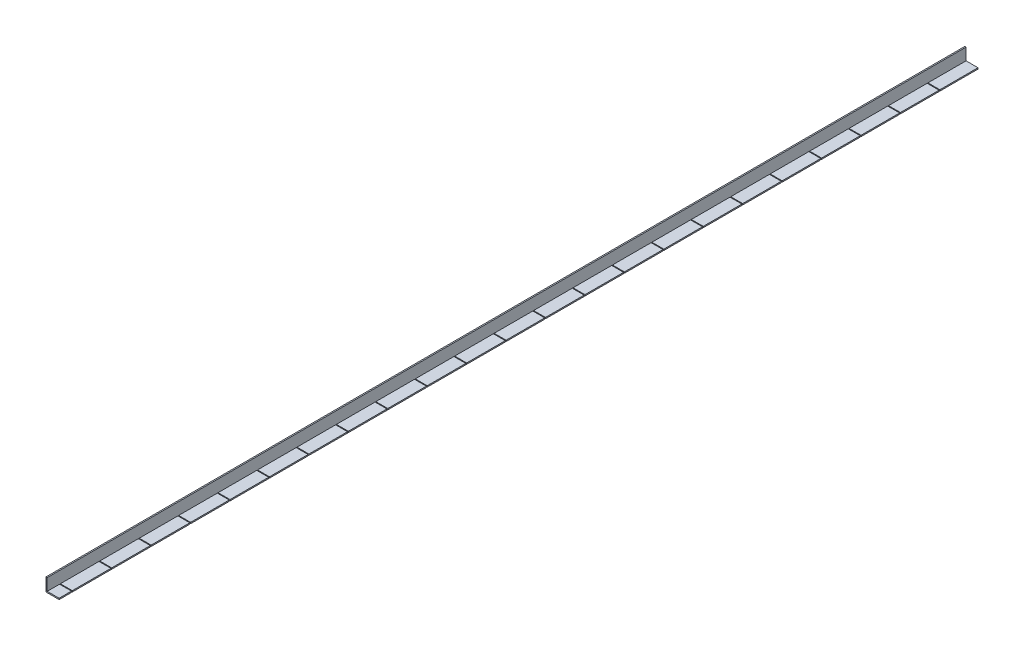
from build123d import *

# Parameters (mm, degrees)
SKETCH1_W            = 50.8
SKETCH1_H            = 3550.92
BOSS_EXTRUDE1_DEPTH  = 4.7625
SKETCH2_W            = 47.625
SKETCH2_H            = 4.7625
BOSS_EXTRUDE2_DEPTH  = 46.0375
SKETCH3_W            = 147.32
SKETCH3_H            = 4.7625
BOSS_EXTRUDE3_DEPTH  = 46.0375
SKETCH4_W            = 149.225
SKETCH4_H            = 4.7625
BOSS_EXTRUDE4_DEPTH  = 46.0375
SKETCH5_W            = 149.225
SKETCH5_H            = 4.7625
BOSS_EXTRUDE5_DEPTH  = 46.0375
SKETCH6_W            = 149.225
SKETCH6_H            = 4.7625
BOSS_EXTRUDE6_DEPTH  = 46.0375
SKETCH7_W            = 149.225
SKETCH7_H            = 4.7625
BOSS_EXTRUDE7_DEPTH  = 46.0375
SKETCH8_W            = 149.225
SKETCH8_H            = 4.7625
BOSS_EXTRUDE8_DEPTH  = 46.0375
SKETCH9_W            = 149.225
SKETCH9_H            = 4.7625
BOSS_EXTRUDE9_DEPTH  = 46.0375
SKETCH10_W           = 149.225
SKETCH10_H           = 4.7625
BOSS_EXTRUDE10_DEPTH = 46.0375
SKETCH11_W           = 149.225
SKETCH11_H           = 4.7625
BOSS_EXTRUDE11_DEPTH = 46.0375
SKETCH12_W           = 149.225
SKETCH12_H           = 4.7625
BOSS_EXTRUDE12_DEPTH = 46.0375
SKETCH13_W           = 149.225
SKETCH13_H           = 4.7625
BOSS_EXTRUDE13_DEPTH = 46.0375
SKETCH14_W           = 149.225
SKETCH14_H           = 4.7625
BOSS_EXTRUDE14_DEPTH = 46.0375
SKETCH15_W           = 149.225
SKETCH15_H           = 4.7625
BOSS_EXTRUDE15_DEPTH = 46.0375
SKETCH16_W           = 149.225
SKETCH16_H           = 4.7625
BOSS_EXTRUDE16_DEPTH = 46.0375
SKETCH17_W           = 149.225
SKETCH17_H           = 4.7625
BOSS_EXTRUDE17_DEPTH = 46.0375
SKETCH18_W           = 149.225
SKETCH18_H           = 4.7625
BOSS_EXTRUDE18_DEPTH = 46.0375
SKETCH19_W           = 149.225
SKETCH19_H           = 4.7625
BOSS_EXTRUDE19_DEPTH = 46.0375
SKETCH20_W           = 149.225
SKETCH20_H           = 4.7625
BOSS_EXTRUDE20_DEPTH = 46.0375
SKETCH21_W           = 149.225
SKETCH21_H           = 4.7625
BOSS_EXTRUDE21_DEPTH = 46.0375
SKETCH22_W           = 149.225
SKETCH22_H           = 4.7625
BOSS_EXTRUDE22_DEPTH = 46.0375
SKETCH23_W           = 149.225
SKETCH23_H           = 4.7625
BOSS_EXTRUDE23_DEPTH = 46.0375
SKETCH24_W           = 149.225
SKETCH24_H           = 4.7625
BOSS_EXTRUDE24_DEPTH = 46.0375
SKETCH25_W           = 149.225
SKETCH25_H           = 4.7625
BOSS_EXTRUDE25_DEPTH = 46.0375


with BuildPart() as part:
    # Sketch1 → Boss-Extrude1 (new body)
    with BuildSketch(Plane(origin=(0, 0, 0), x_dir=(0, -1, 0), z_dir=(-1, 0, 0))):
        with Locations((-25.4, 1775.46)):
            Rectangle(SKETCH1_W, SKETCH1_H)
    extrude(amount=-BOSS_EXTRUDE1_DEPTH)

    # Sketch2 → Boss-Extrude2 (add)
    with BuildSketch(Plane(origin=(4.7625, 0, 0), x_dir=(0, 0, -1), z_dir=(1, 0, 0))):
        with Locations((-3527.1075, 2.38125)):
            Rectangle(SKETCH2_W, SKETCH2_H)
    extrude(amount=BOSS_EXTRUDE2_DEPTH)

    # Sketch3 → Boss-Extrude3 (add)
    with BuildSketch(Plane(origin=(4.7625, 0, 0), x_dir=(0, 0, -1), z_dir=(1, 0, 0))):
        with Locations((-73.66, 2.38125)):
            Rectangle(SKETCH3_W, SKETCH3_H)
    extrude(amount=BOSS_EXTRUDE3_DEPTH)

    # Sketch4 → Boss-Extrude4 (add)
    with BuildSketch(Plane(origin=(4.7625, 0, 0), x_dir=(0, 0, -1), z_dir=(1, 0, 0))):
        with Locations((-3425.5075, 2.38125)):
            Rectangle(SKETCH4_W, SKETCH4_H)
    extrude(amount=BOSS_EXTRUDE4_DEPTH)

    # Sketch5 → Boss-Extrude5 (add)
    with BuildSketch(Plane(origin=(4.7625, 0, 0), x_dir=(0, 0, -1), z_dir=(1, 0, 0))):
        with Locations((-3273.1075, 2.38125)):
            Rectangle(SKETCH5_W, SKETCH5_H)
    extrude(amount=BOSS_EXTRUDE5_DEPTH)

    # Sketch6 → Boss-Extrude6 (add)
    with BuildSketch(Plane(origin=(4.7625, 0, 0), x_dir=(0, 0, -1), z_dir=(1, 0, 0))):
        with Locations((-3120.7075, 2.38125)):
            Rectangle(SKETCH6_W, SKETCH6_H)
    extrude(amount=BOSS_EXTRUDE6_DEPTH)

    # Sketch7 → Boss-Extrude7 (add)
    with BuildSketch(Plane(origin=(4.7625, 0, 0), x_dir=(0, 0, -1), z_dir=(1, 0, 0))):
        with Locations((-2968.3075, 2.38125)):
            Rectangle(SKETCH7_W, SKETCH7_H)
    extrude(amount=BOSS_EXTRUDE7_DEPTH)

    # Sketch8 → Boss-Extrude8 (add)
    with BuildSketch(Plane(origin=(4.7625, 0, 0), x_dir=(0, 0, -1), z_dir=(1, 0, 0))):
        with Locations((-2815.9075, 2.38125)):
            Rectangle(SKETCH8_W, SKETCH8_H)
    extrude(amount=BOSS_EXTRUDE8_DEPTH)

    # Sketch9 → Boss-Extrude9 (add)
    with BuildSketch(Plane(origin=(4.7625, 0, 0), x_dir=(0, 0, -1), z_dir=(1, 0, 0))):
        with Locations((-2663.5075, 2.38125)):
            Rectangle(SKETCH9_W, SKETCH9_H)
    extrude(amount=BOSS_EXTRUDE9_DEPTH)

    # Sketch10 → Boss-Extrude10 (add)
    with BuildSketch(Plane(origin=(4.7625, 0, 0), x_dir=(0, 0, -1), z_dir=(1, 0, 0))):
        with Locations((-2511.1075, 2.38125)):
            Rectangle(SKETCH10_W, SKETCH10_H)
    extrude(amount=BOSS_EXTRUDE10_DEPTH)

    # Sketch11 → Boss-Extrude11 (add)
    with BuildSketch(Plane(origin=(4.7625, 0, 0), x_dir=(0, 0, -1), z_dir=(1, 0, 0))):
        with Locations((-2358.7075, 2.38125)):
            Rectangle(SKETCH11_W, SKETCH11_H)
    extrude(amount=BOSS_EXTRUDE11_DEPTH)

    # Sketch12 → Boss-Extrude12 (add)
    with BuildSketch(Plane(origin=(4.7625, 0, 0), x_dir=(0, 0, -1), z_dir=(1, 0, 0))):
        with Locations((-2206.3075, 2.38125)):
            Rectangle(SKETCH12_W, SKETCH12_H)
    extrude(amount=BOSS_EXTRUDE12_DEPTH)

    # Sketch13 → Boss-Extrude13 (add)
    with BuildSketch(Plane(origin=(4.7625, 0, 0), x_dir=(0, 0, -1), z_dir=(1, 0, 0))):
        with Locations((-2053.9075, 2.38125)):
            Rectangle(SKETCH13_W, SKETCH13_H)
    extrude(amount=BOSS_EXTRUDE13_DEPTH)

    # Sketch14 → Boss-Extrude14 (add)
    with BuildSketch(Plane(origin=(4.7625, 0, 0), x_dir=(0, 0, -1), z_dir=(1, 0, 0))):
        with Locations((-1901.5075, 2.38125)):
            Rectangle(SKETCH14_W, SKETCH14_H)
    extrude(amount=BOSS_EXTRUDE14_DEPTH)

    # Sketch15 → Boss-Extrude15 (add)
    with BuildSketch(Plane(origin=(4.7625, 0, 0), x_dir=(0, 0, -1), z_dir=(1, 0, 0))):
        with Locations((-1749.1075, 2.38125)):
            Rectangle(SKETCH15_W, SKETCH15_H)
    extrude(amount=BOSS_EXTRUDE15_DEPTH)

    # Sketch16 → Boss-Extrude16 (add)
    with BuildSketch(Plane(origin=(4.7625, 0, 0), x_dir=(0, 0, -1), z_dir=(1, 0, 0))):
        with Locations((-1596.7075, 2.38125)):
            Rectangle(SKETCH16_W, SKETCH16_H)
    extrude(amount=BOSS_EXTRUDE16_DEPTH)

    # Sketch17 → Boss-Extrude17 (add)
    with BuildSketch(Plane(origin=(4.7625, 0, 0), x_dir=(0, 0, -1), z_dir=(1, 0, 0))):
        with Locations((-1444.3075, 2.38125)):
            Rectangle(SKETCH17_W, SKETCH17_H)
    extrude(amount=BOSS_EXTRUDE17_DEPTH)

    # Sketch18 → Boss-Extrude18 (add)
    with BuildSketch(Plane(origin=(4.7625, 0, 0), x_dir=(0, 0, -1), z_dir=(1, 0, 0))):
        with Locations((-1291.9075, 2.38125)):
            Rectangle(SKETCH18_W, SKETCH18_H)
    extrude(amount=BOSS_EXTRUDE18_DEPTH)

    # Sketch19 → Boss-Extrude19 (add)
    with BuildSketch(Plane(origin=(4.7625, 0, 0), x_dir=(0, 0, -1), z_dir=(1, 0, 0))):
        with Locations((-1139.5075, 2.38125)):
            Rectangle(SKETCH19_W, SKETCH19_H)
    extrude(amount=BOSS_EXTRUDE19_DEPTH)

    # Sketch20 → Boss-Extrude20 (add)
    with BuildSketch(Plane(origin=(4.7625, 0, 0), x_dir=(0, 0, -1), z_dir=(1, 0, 0))):
        with Locations((-987.1075, 2.38125)):
            Rectangle(SKETCH20_W, SKETCH20_H)
    extrude(amount=BOSS_EXTRUDE20_DEPTH)

    # Sketch21 → Boss-Extrude21 (add)
    with BuildSketch(Plane(origin=(4.7625, 0, 0), x_dir=(0, 0, -1), z_dir=(1, 0, 0))):
        with Locations((-834.7075, 2.38125)):
            Rectangle(SKETCH21_W, SKETCH21_H)
    extrude(amount=BOSS_EXTRUDE21_DEPTH)

    # Sketch22 → Boss-Extrude22 (add)
    with BuildSketch(Plane(origin=(4.7625, 0, 0), x_dir=(0, 0, -1), z_dir=(1, 0, 0))):
        with Locations((-682.3075, 2.38125)):
            Rectangle(SKETCH22_W, SKETCH22_H)
    extrude(amount=BOSS_EXTRUDE22_DEPTH)

    # Sketch23 → Boss-Extrude23 (add)
    with BuildSketch(Plane(origin=(4.7625, 0, 0), x_dir=(0, 0, -1), z_dir=(1, 0, 0))):
        with Locations((-529.9075, 2.38125)):
            Rectangle(SKETCH23_W, SKETCH23_H)
    extrude(amount=BOSS_EXTRUDE23_DEPTH)

    # Sketch24 → Boss-Extrude24 (add)
    with BuildSketch(Plane(origin=(4.7625, 0, 0), x_dir=(0, 0, -1), z_dir=(1, 0, 0))):
        with Locations((-377.5075, 2.38125)):
            Rectangle(SKETCH24_W, SKETCH24_H)
    extrude(amount=BOSS_EXTRUDE24_DEPTH)

    # Sketch25 → Boss-Extrude25 (add)
    with BuildSketch(Plane(origin=(4.7625, 0, 0), x_dir=(0, 0, -1), z_dir=(1, 0, 0))):
        with Locations((-225.1075, 2.38125)):
            Rectangle(SKETCH25_W, SKETCH25_H)
    extrude(amount=BOSS_EXTRUDE25_DEPTH)


solid = part.part
